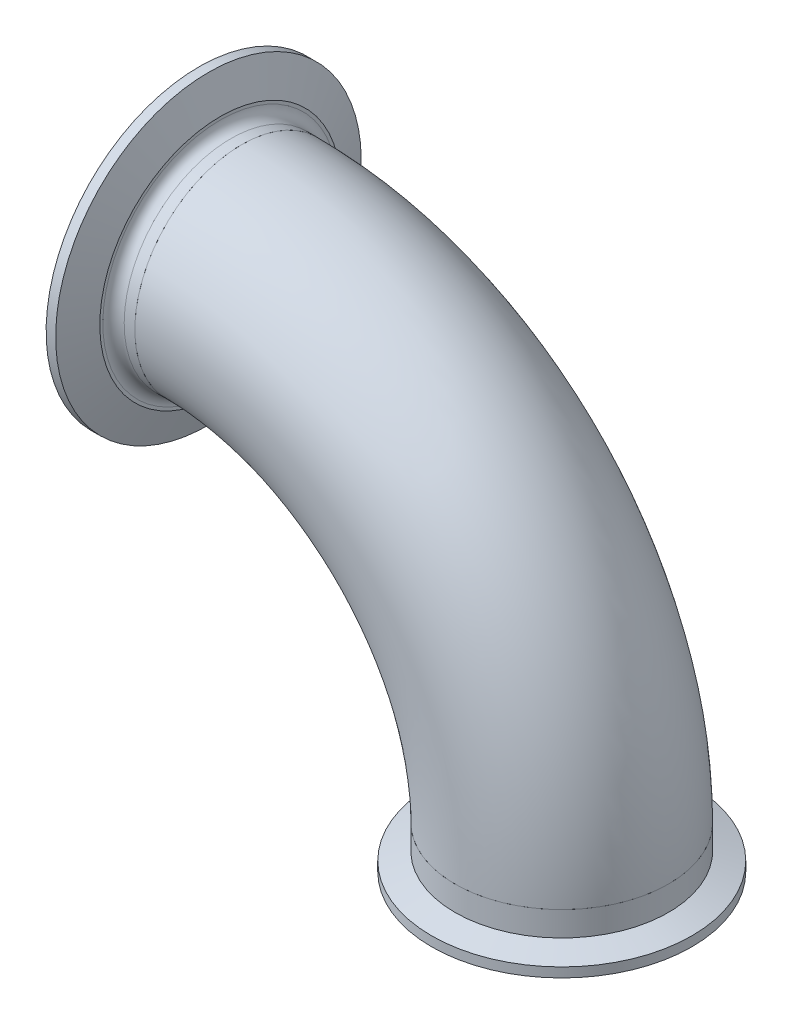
ISO-10303-21;
HEADER;
FILE_DESCRIPTION(('STEP AP214'),'2;1');
FILE_NAME('part.step','',(''),(''),'','','');
FILE_SCHEMA(('AUTOMOTIVE_DESIGN { 1 0 10303 214 1 1 1 1 }'));
ENDSEC;
DATA;
#1=APPLICATION_CONTEXT('core data for automotive mechanical design processes');
#2=APPLICATION_PROTOCOL_DEFINITION('international standard','automotive_design',2000,#1);
#3=PRODUCT_CONTEXT('',#1,'mechanical');
#4=PRODUCT('Part','Part','',(#3));
#5=PRODUCT_RELATED_PRODUCT_CATEGORY('part','',(#4));
#6=PRODUCT_DEFINITION_FORMATION('','',#4);
#7=PRODUCT_DEFINITION_CONTEXT('part definition',#1,'design');
#8=PRODUCT_DEFINITION('design','',#6,#7);
#9=PRODUCT_DEFINITION_SHAPE('','',#8);
#10=(LENGTH_UNIT() NAMED_UNIT(*) SI_UNIT(.MILLI.,.METRE.));
#11=(NAMED_UNIT(*) PLANE_ANGLE_UNIT() SI_UNIT($,.RADIAN.));
#12=(NAMED_UNIT(*) SI_UNIT($,.STERADIAN.) SOLID_ANGLE_UNIT());
#13=UNCERTAINTY_MEASURE_WITH_UNIT(LENGTH_MEASURE(1.E-05),#10,'distance_accuracy_value','');
#14=(GEOMETRIC_REPRESENTATION_CONTEXT(3) GLOBAL_UNCERTAINTY_ASSIGNED_CONTEXT((#13)) GLOBAL_UNIT_ASSIGNED_CONTEXT((#10,
#11,#12)) REPRESENTATION_CONTEXT('',''));
#15=CARTESIAN_POINT('',(0.,0.,0.));
#16=DIRECTION('',(0.,0.,1.));
#17=DIRECTION('',(1.,0.,0.));
#18=AXIS2_PLACEMENT_3D('',#15,#16,#17);
#19=CARTESIAN_POINT('',(5.89425065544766,43.0349954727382,135.177677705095));
#20=DIRECTION('',(0.,0.,-1.));
#21=DIRECTION('',(-1.,0.,0.));
#22=AXIS2_PLACEMENT_3D('',#19,#20,#21);
#23=TOROIDAL_SURFACE('',#22,95.25,31.75);
#24=CARTESIAN_POINT('',(5.89425065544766,138.284995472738,135.177677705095));
#25=DIRECTION('',(-1.,0.,0.));
#26=DIRECTION('',(0.,0.,1.));
#27=AXIS2_PLACEMENT_3D('',#24,#25,#26);
#28=CIRCLE('',#27,31.75);
#29=CARTESIAN_POINT('',(5.89425065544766,170.034995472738,135.177677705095));
#30=VERTEX_POINT('',#29);
#31=EDGE_CURVE('P0_E10',#30,#30,#28,.T.);
#32=CARTESIAN_POINT('',(101.144250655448,43.0349954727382,135.177677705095));
#33=DIRECTION('',(0.,1.,0.));
#34=DIRECTION('',(0.,0.,1.));
#35=AXIS2_PLACEMENT_3D('',#32,#33,#34);
#36=CIRCLE('',#35,31.75);
#37=CARTESIAN_POINT('',(132.894250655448,43.0349954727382,135.177677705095));
#38=VERTEX_POINT('',#37);
#39=EDGE_CURVE('P0_E21',#38,#38,#36,.T.);
#40=CARTESIAN_POINT('',(5.89425065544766,43.0349954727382,135.177677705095));
#41=DIRECTION('',(0.,0.,-1.));
#42=DIRECTION('',(-1.,0.,0.));
#43=AXIS2_PLACEMENT_3D('',#40,#41,#42);
#44=CIRCLE('',#43,127.);
#45=EDGE_CURVE('',#30,#38,#44,.T.);
#46=ORIENTED_EDGE('',*,*,#31,.F.);
#47=ORIENTED_EDGE('',*,*,#39,.T.);
#48=ORIENTED_EDGE('',*,*,#45,.T.);
#49=ORIENTED_EDGE('',*,*,#45,.F.);
#50=EDGE_LOOP('',(#46,#48,#47,#49));
#51=FACE_BOUND('',#50,.T.);
#52=ADVANCED_FACE('P0_F15',(#51),#23,.T.);
#53=CARTESIAN_POINT('',(5.89425065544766,138.284995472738,135.177677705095));
#54=DIRECTION('',(-1.,0.,0.));
#55=DIRECTION('',(0.,0.,1.));
#56=AXIS2_PLACEMENT_3D('',#53,#54,#55);
#57=PLANE('',#56);
#58=CARTESIAN_POINT('',(5.89425065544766,138.284995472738,135.177677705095));
#59=DIRECTION('',(-1.,0.,0.));
#60=DIRECTION('',(0.,-1.,0.));
#61=AXIS2_PLACEMENT_3D('',#58,#59,#60);
#62=CIRCLE('',#61,30.099);
#63=CARTESIAN_POINT('',(5.89425065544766,168.383995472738,135.177677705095));
#64=VERTEX_POINT('',#63);
#65=EDGE_CURVE('P0_E25',#64,#64,#62,.T.);
#66=ORIENTED_EDGE('',*,*,#65,.F.);
#67=EDGE_LOOP('',(#66));
#68=FACE_BOUND('',#67,.T.);
#69=ORIENTED_EDGE('',*,*,#31,.T.);
#70=EDGE_LOOP('',(#69));
#71=FACE_BOUND('',#70,.T.);
#72=ADVANCED_FACE('P0_F46',(#68,#71),#57,.T.);
#73=CARTESIAN_POINT('',(101.144250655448,43.0349954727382,135.177677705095));
#74=DIRECTION('',(0.,1.,0.));
#75=DIRECTION('',(0.,0.,1.));
#76=AXIS2_PLACEMENT_3D('',#73,#74,#75);
#77=PLANE('',#76);
#78=CARTESIAN_POINT('',(101.144250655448,43.0349954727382,135.177677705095));
#79=DIRECTION('',(0.,1.,0.));
#80=DIRECTION('',(0.,0.,1.));
#81=AXIS2_PLACEMENT_3D('',#78,#79,#80);
#82=CIRCLE('',#81,30.099);
#83=CARTESIAN_POINT('',(131.243250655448,43.0349954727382,135.177677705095));
#84=VERTEX_POINT('',#83);
#85=EDGE_CURVE('P0_E29',#84,#84,#82,.T.);
#86=ORIENTED_EDGE('',*,*,#85,.T.);
#87=EDGE_LOOP('',(#86));
#88=FACE_BOUND('',#87,.T.);
#89=ORIENTED_EDGE('',*,*,#39,.F.);
#90=EDGE_LOOP('',(#89));
#91=FACE_BOUND('',#90,.T.);
#92=ADVANCED_FACE('P0_F35',(#88,#91),#77,.F.);
#93=CARTESIAN_POINT('',(5.89425065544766,43.0349954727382,135.177677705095));
#94=DIRECTION('',(0.,0.,-1.));
#95=DIRECTION('',(-1.,0.,0.));
#96=AXIS2_PLACEMENT_3D('',#93,#94,#95);
#97=TOROIDAL_SURFACE('',#96,95.25,30.099);
#98=CARTESIAN_POINT('',(5.89425065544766,43.0349954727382,135.177677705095));
#99=DIRECTION('',(0.,0.,-1.));
#100=DIRECTION('',(-1.,0.,0.));
#101=AXIS2_PLACEMENT_3D('',#98,#99,#100);
#102=CIRCLE('',#101,125.349);
#103=EDGE_CURVE('',#64,#84,#102,.T.);
#104=ORIENTED_EDGE('',*,*,#65,.T.);
#105=ORIENTED_EDGE('',*,*,#85,.F.);
#106=ORIENTED_EDGE('',*,*,#103,.T.);
#107=ORIENTED_EDGE('',*,*,#103,.F.);
#108=EDGE_LOOP('',(#104,#106,#105,#107));
#109=FACE_BOUND('',#108,.T.);
#110=ADVANCED_FACE('P0_F38',(#109),#97,.F.);
#111=CLOSED_SHELL('',(#52,#72,#92,#110));
#112=MANIFOLD_SOLID_BREP('P0_B1',#111);
#113=CARTESIAN_POINT('',(5.89425065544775,162.342666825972,153.265746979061));
#114=DIRECTION('',(-1.,0.,0.));
#115=DIRECTION('',(0.,0.600952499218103,-0.799284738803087));
#116=AXIS2_PLACEMENT_3D('',#113,#114,#115);
#117=PLANE('',#116);
#118=CARTESIAN_POINT('',(5.89425065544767,138.284995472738,135.177677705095));
#119=DIRECTION('',(-1.,0.,0.));
#120=DIRECTION('',(0.,0.600952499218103,-0.799284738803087));
#121=AXIS2_PLACEMENT_3D('',#118,#119,#120);
#122=CIRCLE('',#121,31.75);
#123=CARTESIAN_POINT('',(5.89425065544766,157.365237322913,109.800387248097));
#124=VERTEX_POINT('',#123);
#125=EDGE_CURVE('P1_E9',#124,#124,#122,.T.);
#126=ORIENTED_EDGE('',*,*,#125,.F.);
#127=EDGE_LOOP('',(#126));
#128=FACE_BOUND('',#127,.T.);
#129=CARTESIAN_POINT('',(5.89425065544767,138.284995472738,135.177677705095));
#130=DIRECTION('',(-1.,0.,0.));
#131=DIRECTION('',(0.,0.600952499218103,-0.799284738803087));
#132=AXIS2_PLACEMENT_3D('',#129,#130,#131);
#133=CIRCLE('',#132,30.099);
#134=CARTESIAN_POINT('',(5.89425065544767,156.373064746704,111.120006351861));
#135=VERTEX_POINT('',#134);
#136=EDGE_CURVE('P1_E63',#135,#135,#133,.T.);
#137=ORIENTED_EDGE('',*,*,#136,.T.);
#138=EDGE_LOOP('',(#137));
#139=FACE_BOUND('',#138,.T.);
#140=ADVANCED_FACE('P1_F14',(#128,#139),#117,.F.);
#141=CARTESIAN_POINT('',(-6.80574934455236,138.284995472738,135.177677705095));
#142=DIRECTION('',(-1.,0.,0.));
#143=DIRECTION('',(0.,0.600952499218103,-0.799284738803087));
#144=AXIS2_PLACEMENT_3D('',#141,#142,#143);
#145=CYLINDRICAL_SURFACE('',#144,31.75);
#146=CARTESIAN_POINT('',(2.71925065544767,138.284995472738,135.177677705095));
#147=DIRECTION('',(-1.,0.,0.));
#148=DIRECTION('',(0.,0.600952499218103,-0.799284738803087));
#149=AXIS2_PLACEMENT_3D('',#146,#147,#148);
#150=CIRCLE('',#149,31.75);
#151=CARTESIAN_POINT('',(2.71925065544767,157.365237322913,109.800387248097));
#152=VERTEX_POINT('',#151);
#153=EDGE_CURVE('P1_E20',#152,#152,#150,.T.);
#154=ORIENTED_EDGE('',*,*,#153,.F.);
#155=EDGE_LOOP('',(#154));
#156=FACE_BOUND('',#155,.T.);
#157=ORIENTED_EDGE('',*,*,#125,.T.);
#158=EDGE_LOOP('',(#157));
#159=FACE_BOUND('',#158,.T.);
#160=ADVANCED_FACE('P1_F142',(#156,#159),#145,.T.);
#161=CARTESIAN_POINT('',(2.71925065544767,138.284995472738,135.177677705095));
#162=DIRECTION('',(-1.,0.,0.));
#163=DIRECTION('',(0.,0.600952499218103,-0.799284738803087));
#164=AXIS2_PLACEMENT_3D('',#161,#162,#163);
#165=TOROIDAL_SURFACE('',#164,34.925,3.175);
#166=CARTESIAN_POINT('',(-0.455749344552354,138.284995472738,135.177677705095));
#167=DIRECTION('',(-1.,0.,0.));
#168=DIRECTION('',(0.,0.600952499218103,-0.799284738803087));
#169=AXIS2_PLACEMENT_3D('',#166,#167,#168);
#170=CIRCLE('',#169,34.925);
#171=CARTESIAN_POINT('',(-0.455749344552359,159.27326150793,107.262658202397));
#172=VERTEX_POINT('',#171);
#173=EDGE_CURVE('P1_E24',#172,#172,#170,.T.);
#174=ORIENTED_EDGE('',*,*,#173,.F.);
#175=EDGE_LOOP('',(#174));
#176=FACE_BOUND('',#175,.T.);
#177=ORIENTED_EDGE('',*,*,#153,.T.);
#178=EDGE_LOOP('',(#177));
#179=FACE_BOUND('',#178,.T.);
#180=ADVANCED_FACE('P1_F137',(#176,#179),#165,.F.);
#181=CARTESIAN_POINT('',(-0.45574934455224,166.200014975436,156.165943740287));
#182=DIRECTION('',(-1.,0.,0.));
#183=DIRECTION('',(0.,0.600952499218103,-0.799284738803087));
#184=AXIS2_PLACEMENT_3D('',#181,#182,#183);
#185=PLANE('',#184);
#186=CARTESIAN_POINT('',(-0.455749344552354,138.284995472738,135.177677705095));
#187=DIRECTION('',(-1.,0.,0.));
#188=DIRECTION('',(0.,0.600952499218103,-0.799284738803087));
#189=AXIS2_PLACEMENT_3D('',#186,#187,#188);
#190=CIRCLE('',#189,35.8228421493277);
#191=CARTESIAN_POINT('',(-0.45574934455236,159.812821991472,106.545026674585));
#192=VERTEX_POINT('',#191);
#193=EDGE_CURVE('P1_E28',#192,#192,#190,.T.);
#194=ORIENTED_EDGE('',*,*,#193,.F.);
#195=EDGE_LOOP('',(#194));
#196=FACE_BOUND('',#195,.T.);
#197=ORIENTED_EDGE('',*,*,#173,.T.);
#198=EDGE_LOOP('',(#197));
#199=FACE_BOUND('',#198,.T.);
#200=ADVANCED_FACE('P1_F131',(#196,#199),#185,.F.);
#201=CARTESIAN_POINT('',(-0.455749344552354,138.284995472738,135.177677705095));
#202=DIRECTION('',(-1.,0.,0.));
#203=DIRECTION('',(0.,0.600952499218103,-0.799284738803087));
#204=AXIS2_PLACEMENT_3D('',#201,#202,#203);
#205=CONICAL_SURFACE('',#204,35.8228421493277,1.22173047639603);
#206=CARTESIAN_POINT('',(-3.96094934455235,138.284995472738,135.177677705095));
#207=DIRECTION('',(-1.,0.,0.));
#208=DIRECTION('',(0.,0.600952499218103,-0.799284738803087));
#209=AXIS2_PLACEMENT_3D('',#206,#207,#208);
#210=CIRCLE('',#209,45.4533);
#211=CARTESIAN_POINT('',(-3.96094934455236,165.600269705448,98.8475486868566));
#212=VERTEX_POINT('',#211);
#213=EDGE_CURVE('P1_E33',#212,#212,#210,.T.);
#214=ORIENTED_EDGE('',*,*,#213,.F.);
#215=EDGE_LOOP('',(#214));
#216=FACE_BOUND('',#215,.T.);
#217=ORIENTED_EDGE('',*,*,#193,.T.);
#218=EDGE_LOOP('',(#217));
#219=FACE_BOUND('',#218,.T.);
#220=ADVANCED_FACE('P1_F125',(#216,#219),#205,.T.);
#221=CARTESIAN_POINT('',(-6.80574934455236,138.284995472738,135.177677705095));
#222=DIRECTION('',(-1.,0.,0.));
#223=DIRECTION('',(0.,0.600952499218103,-0.799284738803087));
#224=AXIS2_PLACEMENT_3D('',#221,#222,#223);
#225=CYLINDRICAL_SURFACE('',#224,45.4533);
#226=CARTESIAN_POINT('',(-6.80574934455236,138.284995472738,135.177677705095));
#227=DIRECTION('',(-1.,0.,0.));
#228=DIRECTION('',(0.,0.600952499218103,-0.799284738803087));
#229=AXIS2_PLACEMENT_3D('',#226,#227,#228);
#230=CIRCLE('',#229,45.4533);
#231=CARTESIAN_POINT('',(-6.80574934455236,165.600269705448,98.8475486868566));
#232=VERTEX_POINT('',#231);
#233=EDGE_CURVE('P1_E36',#232,#232,#230,.T.);
#234=ORIENTED_EDGE('',*,*,#233,.F.);
#235=EDGE_LOOP('',(#234));
#236=FACE_BOUND('',#235,.T.);
#237=ORIENTED_EDGE('',*,*,#213,.T.);
#238=EDGE_LOOP('',(#237));
#239=FACE_BOUND('',#238,.T.);
#240=ADVANCED_FACE('P1_F119',(#236,#239),#225,.T.);
#241=CARTESIAN_POINT('',(-6.80574934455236,138.284995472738,135.177677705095));
#242=DIRECTION('',(-1.,0.,0.));
#243=DIRECTION('',(0.,0.600952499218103,-0.799284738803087));
#244=AXIS2_PLACEMENT_3D('',#241,#242,#243);
#245=CONICAL_SURFACE('',#244,45.4533,1.56939586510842);
#246=CARTESIAN_POINT('',(-6.80323687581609,138.284995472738,135.177677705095));
#247=DIRECTION('',(-1.,0.,0.));
#248=DIRECTION('',(0.,0.600952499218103,-0.799284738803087));
#249=AXIS2_PLACEMENT_3D('',#246,#247,#248);
#250=CIRCLE('',#249,43.6592722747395);
#251=CARTESIAN_POINT('',(-6.80323687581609,164.522144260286,100.281487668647));
#252=VERTEX_POINT('',#251);
#253=EDGE_CURVE('P1_E39',#252,#252,#250,.T.);
#254=ORIENTED_EDGE('',*,*,#253,.F.);
#255=EDGE_LOOP('',(#254));
#256=FACE_BOUND('',#255,.T.);
#257=ORIENTED_EDGE('',*,*,#233,.T.);
#258=EDGE_LOOP('',(#257));
#259=FACE_BOUND('',#258,.T.);
#260=ADVANCED_FACE('P1_F113',(#256,#259),#245,.F.);
#261=CARTESIAN_POINT('',(-6.01583687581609,138.284995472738,135.177677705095));
#262=DIRECTION('',(-1.,0.,0.));
#263=DIRECTION('',(0.,0.600952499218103,-0.799284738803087));
#264=AXIS2_PLACEMENT_3D('',#261,#262,#263);
#265=TOROIDAL_SURFACE('',#264,43.6592722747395,0.787399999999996);
#266=CARTESIAN_POINT('',(-6.32349856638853,138.284995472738,135.177677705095));
#267=DIRECTION('',(-1.,0.,0.));
#268=DIRECTION('',(0.,0.600952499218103,-0.799284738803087));
#269=AXIS2_PLACEMENT_3D('',#266,#267,#268);
#270=CIRCLE('',#269,42.9344667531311);
#271=CARTESIAN_POINT('',(-6.32349856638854,164.086570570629,100.860813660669));
#272=VERTEX_POINT('',#271);
#273=EDGE_CURVE('P1_E42',#272,#272,#270,.T.);
#274=ORIENTED_EDGE('',*,*,#273,.F.);
#275=EDGE_LOOP('',(#274));
#276=FACE_BOUND('',#275,.T.);
#277=ORIENTED_EDGE('',*,*,#253,.T.);
#278=EDGE_LOOP('',(#277));
#279=FACE_BOUND('',#278,.T.);
#280=ADVANCED_FACE('P1_F107',(#276,#279),#265,.T.);
#281=CARTESIAN_POINT('',(-6.32349856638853,138.284995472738,135.177677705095));
#282=DIRECTION('',(-1.,0.,0.));
#283=DIRECTION('',(0.,0.600952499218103,-0.799284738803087));
#284=AXIS2_PLACEMENT_3D('',#281,#282,#283);
#285=CONICAL_SURFACE('',#284,42.9344667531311,0.401425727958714);
#286=CARTESIAN_POINT('',(-5.9303820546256,138.284995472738,135.177677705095));
#287=DIRECTION('',(-1.,0.,0.));
#288=DIRECTION('',(0.,0.600952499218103,-0.799284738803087));
#289=AXIS2_PLACEMENT_3D('',#286,#287,#288);
#290=CIRCLE('',#289,42.7675986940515);
#291=CARTESIAN_POINT('',(-5.9303820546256,163.986290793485,100.994188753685));
#292=VERTEX_POINT('',#291);
#293=EDGE_CURVE('P1_E45',#292,#292,#290,.T.);
#294=ORIENTED_EDGE('',*,*,#293,.F.);
#295=EDGE_LOOP('',(#294));
#296=FACE_BOUND('',#295,.T.);
#297=ORIENTED_EDGE('',*,*,#273,.T.);
#298=EDGE_LOOP('',(#297));
#299=FACE_BOUND('',#298,.T.);
#300=ADVANCED_FACE('P1_F101',(#296,#299),#285,.F.);
#301=CARTESIAN_POINT('',(-6.39683687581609,138.284995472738,135.177677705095));
#302=DIRECTION('',(-1.,0.,0.));
#303=DIRECTION('',(0.,0.600952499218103,-0.799284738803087));
#304=AXIS2_PLACEMENT_3D('',#301,#302,#303);
#305=TOROIDAL_SURFACE('',#304,41.6687,1.19379999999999);
#306=CARTESIAN_POINT('',(-5.93038205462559,138.284995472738,135.177677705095));
#307=DIRECTION('',(-1.,0.,0.));
#308=DIRECTION('',(0.,0.600952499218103,-0.799284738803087));
#309=AXIS2_PLACEMENT_3D('',#306,#307,#308);
#310=CIRCLE('',#309,40.5698013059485);
#311=CARTESIAN_POINT('',(-5.9303820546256,162.66551896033,102.750854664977));
#312=VERTEX_POINT('',#311);
#313=EDGE_CURVE('P1_E48',#312,#312,#310,.T.);
#314=ORIENTED_EDGE('',*,*,#313,.F.);
#315=EDGE_LOOP('',(#314));
#316=FACE_BOUND('',#315,.T.);
#317=ORIENTED_EDGE('',*,*,#293,.T.);
#318=EDGE_LOOP('',(#317));
#319=FACE_BOUND('',#318,.T.);
#320=ADVANCED_FACE('P1_F95',(#316,#319),#305,.F.);
#321=CARTESIAN_POINT('',(-5.93038205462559,138.284995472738,135.177677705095));
#322=DIRECTION('',(1.,0.,0.));
#323=DIRECTION('',(0.,-0.600952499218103,0.799284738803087));
#324=AXIS2_PLACEMENT_3D('',#321,#322,#323);
#325=CONICAL_SURFACE('',#324,40.5698013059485,0.401425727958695);
#326=CARTESIAN_POINT('',(-6.32349856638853,138.284995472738,135.177677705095));
#327=DIRECTION('',(-1.,0.,0.));
#328=DIRECTION('',(0.,0.600952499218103,-0.799284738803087));
#329=AXIS2_PLACEMENT_3D('',#326,#327,#328);
#330=CIRCLE('',#329,40.402933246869);
#331=CARTESIAN_POINT('',(-6.32349856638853,162.565239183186,102.884229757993));
#332=VERTEX_POINT('',#331);
#333=EDGE_CURVE('P1_E51',#332,#332,#330,.T.);
#334=ORIENTED_EDGE('',*,*,#333,.F.);
#335=EDGE_LOOP('',(#334));
#336=FACE_BOUND('',#335,.T.);
#337=ORIENTED_EDGE('',*,*,#313,.T.);
#338=EDGE_LOOP('',(#337));
#339=FACE_BOUND('',#338,.T.);
#340=ADVANCED_FACE('P1_F89',(#336,#339),#325,.T.);
#341=CARTESIAN_POINT('',(-6.01583687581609,138.284995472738,135.177677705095));
#342=DIRECTION('',(-1.,0.,0.));
#343=DIRECTION('',(0.,0.600952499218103,-0.799284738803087));
#344=AXIS2_PLACEMENT_3D('',#341,#342,#343);
#345=TOROIDAL_SURFACE('',#344,39.6781277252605,0.787399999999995);
#346=CARTESIAN_POINT('',(-6.80323687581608,138.284995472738,135.177677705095));
#347=DIRECTION('',(-1.,0.,0.));
#348=DIRECTION('',(0.,0.600952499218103,-0.799284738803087));
#349=AXIS2_PLACEMENT_3D('',#346,#347,#348);
#350=CIRCLE('',#349,39.6781277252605);
#351=CARTESIAN_POINT('',(-6.80323687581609,162.129665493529,103.463555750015));
#352=VERTEX_POINT('',#351);
#353=EDGE_CURVE('P1_E54',#352,#352,#350,.T.);
#354=ORIENTED_EDGE('',*,*,#353,.F.);
#355=EDGE_LOOP('',(#354));
#356=FACE_BOUND('',#355,.T.);
#357=ORIENTED_EDGE('',*,*,#333,.T.);
#358=EDGE_LOOP('',(#357));
#359=FACE_BOUND('',#358,.T.);
#360=ADVANCED_FACE('P1_F83',(#356,#359),#345,.T.);
#361=CARTESIAN_POINT('',(-6.80323687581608,138.284995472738,135.177677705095));
#362=DIRECTION('',(1.,0.,0.));
#363=DIRECTION('',(0.,-0.600952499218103,0.799284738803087));
#364=AXIS2_PLACEMENT_3D('',#361,#362,#363);
#365=CONICAL_SURFACE('',#364,39.6781277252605,1.57001826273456);
#366=CARTESIAN_POINT('',(-6.80574934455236,138.284995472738,135.177677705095));
#367=DIRECTION('',(-1.,0.,0.));
#368=DIRECTION('',(0.,0.600952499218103,-0.799284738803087));
#369=AXIS2_PLACEMENT_3D('',#366,#367,#368);
#370=CIRCLE('',#369,36.449);
#371=CARTESIAN_POINT('',(-6.80574934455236,160.189113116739,106.044548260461));
#372=VERTEX_POINT('',#371);
#373=EDGE_CURVE('P1_E57',#372,#372,#370,.T.);
#374=ORIENTED_EDGE('',*,*,#373,.F.);
#375=EDGE_LOOP('',(#374));
#376=FACE_BOUND('',#375,.T.);
#377=ORIENTED_EDGE('',*,*,#353,.T.);
#378=EDGE_LOOP('',(#377));
#379=FACE_BOUND('',#378,.T.);
#380=ADVANCED_FACE('P1_F77',(#376,#379),#365,.T.);
#381=CARTESIAN_POINT('',(-6.80574934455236,138.284995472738,135.177677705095));
#382=DIRECTION('',(-1.,0.,0.));
#383=DIRECTION('',(0.,0.600952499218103,-0.799284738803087));
#384=AXIS2_PLACEMENT_3D('',#381,#382,#383);
#385=CONICAL_SURFACE('',#384,36.449,0.682423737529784);
#386=CARTESIAN_POINT('',(1.00792390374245,138.284995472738,135.177677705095));
#387=DIRECTION('',(-1.,0.,0.));
#388=DIRECTION('',(0.,0.600952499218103,-0.799284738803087));
#389=AXIS2_PLACEMENT_3D('',#386,#387,#388);
#390=CIRCLE('',#389,30.099);
#391=CARTESIAN_POINT('',(1.00792390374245,156.373064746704,111.120006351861));
#392=VERTEX_POINT('',#391);
#393=EDGE_CURVE('P1_E60',#392,#392,#390,.T.);
#394=ORIENTED_EDGE('',*,*,#393,.F.);
#395=EDGE_LOOP('',(#394));
#396=FACE_BOUND('',#395,.T.);
#397=ORIENTED_EDGE('',*,*,#373,.T.);
#398=EDGE_LOOP('',(#397));
#399=FACE_BOUND('',#398,.T.);
#400=ADVANCED_FACE('P1_F71',(#396,#399),#385,.F.);
#401=CARTESIAN_POINT('',(-6.80574934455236,138.284995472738,135.177677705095));
#402=DIRECTION('',(-1.,0.,0.));
#403=DIRECTION('',(0.,0.600952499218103,-0.799284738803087));
#404=AXIS2_PLACEMENT_3D('',#401,#402,#403);
#405=CYLINDRICAL_SURFACE('',#404,30.099);
#406=ORIENTED_EDGE('',*,*,#136,.F.);
#407=EDGE_LOOP('',(#406));
#408=FACE_BOUND('',#407,.T.);
#409=ORIENTED_EDGE('',*,*,#393,.T.);
#410=EDGE_LOOP('',(#409));
#411=FACE_BOUND('',#410,.T.);
#412=ADVANCED_FACE('P1_F68',(#408,#411),#405,.F.);
#413=CLOSED_SHELL('',(#140,#160,#180,#200,#220,#240,#260,#280,#300,#320,#340,#360,#380,#400,#412));
#414=MANIFOLD_SOLID_BREP('P1_B1',#413);
#415=CARTESIAN_POINT('',(101.144250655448,31.1223954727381,135.177677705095));
#416=DIRECTION('',(0.,-1.00000000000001,0.));
#417=DIRECTION('',(0.,0.,-1.));
#418=AXIS2_PLACEMENT_3D('',#415,#416,#417);
#419=TOROIDAL_SURFACE('',#418,37.1367084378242,0.787400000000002);
#420=CARTESIAN_POINT('',(101.144250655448,30.334995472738,135.177677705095));
#421=DIRECTION('',(0.,-1.00000000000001,0.));
#422=DIRECTION('',(0.,0.,-1.));
#423=AXIS2_PLACEMENT_3D('',#420,#421,#422);
#424=CIRCLE('',#423,37.1367084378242);
#425=CARTESIAN_POINT('',(101.144250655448,30.334995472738,98.0409692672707));
#426=VERTEX_POINT('',#425);
#427=EDGE_CURVE('P2_E49',#426,#426,#424,.T.);
#428=ORIENTED_EDGE('',*,*,#427,.T.);
#429=EDGE_LOOP('',(#428));
#430=FACE_BOUND('',#429,.T.);
#431=CARTESIAN_POINT('',(101.144250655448,30.8094544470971,135.177677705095));
#432=DIRECTION('',(0.,-1.00000000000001,0.));
#433=DIRECTION('',(0.,0.,-1.));
#434=AXIS2_PLACEMENT_3D('',#431,#432,#433);
#435=CIRCLE('',#434,36.4141666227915);
#436=CARTESIAN_POINT('',(101.144250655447,30.809454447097,98.7635110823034));
#437=VERTEX_POINT('',#436);
#438=EDGE_CURVE('P2_E10',#437,#437,#435,.T.);
#439=ORIENTED_EDGE('',*,*,#438,.F.);
#440=EDGE_LOOP('',(#439));
#441=FACE_BOUND('',#440,.T.);
#442=ADVANCED_FACE('P2_F15',(#430,#441),#419,.T.);
#443=CARTESIAN_POINT('',(101.144250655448,30.334995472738,135.177677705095));
#444=DIRECTION('',(0.,-1.00000000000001,0.));
#445=DIRECTION('',(0.,0.,-1.));
#446=AXIS2_PLACEMENT_3D('',#443,#444,#445);
#447=TOROIDAL_SURFACE('',#446,35.3187,1.1938);
#448=CARTESIAN_POINT('',(101.144250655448,30.8094544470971,135.177677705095));
#449=DIRECTION('',(0.,-1.00000000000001,0.));
#450=DIRECTION('',(0.,0.,-1.));
#451=AXIS2_PLACEMENT_3D('',#448,#449,#450);
#452=CIRCLE('',#451,34.2232333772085);
#453=CARTESIAN_POINT('',(101.144250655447,30.809454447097,100.954444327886));
#454=VERTEX_POINT('',#453);
#455=EDGE_CURVE('P2_E21',#454,#454,#452,.T.);
#456=ORIENTED_EDGE('',*,*,#455,.F.);
#457=EDGE_LOOP('',(#456));
#458=FACE_BOUND('',#457,.T.);
#459=ORIENTED_EDGE('',*,*,#438,.T.);
#460=EDGE_LOOP('',(#459));
#461=FACE_BOUND('',#460,.T.);
#462=ADVANCED_FACE('P2_F98',(#458,#461),#447,.F.);
#463=CARTESIAN_POINT('',(101.144250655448,31.1223954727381,135.177677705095));
#464=DIRECTION('',(0.,-1.00000000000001,0.));
#465=DIRECTION('',(0.,0.,-1.));
#466=AXIS2_PLACEMENT_3D('',#463,#464,#465);
#467=TOROIDAL_SURFACE('',#466,33.5006915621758,0.787399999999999);
#468=ORIENTED_EDGE('',*,*,#455,.T.);
#469=EDGE_LOOP('',(#468));
#470=FACE_BOUND('',#469,.T.);
#471=CARTESIAN_POINT('',(101.144250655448,30.334995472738,135.177677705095));
#472=DIRECTION('',(0.,-1.00000000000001,0.));
#473=DIRECTION('',(0.,0.,-1.));
#474=AXIS2_PLACEMENT_3D('',#471,#472,#473);
#475=CIRCLE('',#474,33.5006915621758);
#476=CARTESIAN_POINT('',(101.144250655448,30.334995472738,101.676986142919));
#477=VERTEX_POINT('',#476);
#478=EDGE_CURVE('P2_E25',#477,#477,#475,.T.);
#479=ORIENTED_EDGE('',*,*,#478,.F.);
#480=EDGE_LOOP('',(#479));
#481=FACE_BOUND('',#480,.T.);
#482=ADVANCED_FACE('P2_F94',(#470,#481),#467,.T.);
#483=CARTESIAN_POINT('',(101.144250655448,30.334995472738,135.177677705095));
#484=DIRECTION('',(0.,1.00000000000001,0.));
#485=DIRECTION('',(0.,0.,1.));
#486=AXIS2_PLACEMENT_3D('',#483,#484,#485);
#487=PLANE('',#486);
#488=CARTESIAN_POINT('',(101.144250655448,30.334995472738,135.177677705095));
#489=DIRECTION('',(0.,-1.00000000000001,0.));
#490=DIRECTION('',(0.,0.,-1.));
#491=AXIS2_PLACEMENT_3D('',#488,#489,#490);
#492=CIRCLE('',#491,30.099);
#493=CARTESIAN_POINT('',(101.144250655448,30.334995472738,105.078677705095));
#494=VERTEX_POINT('',#493);
#495=EDGE_CURVE('P2_E29',#494,#494,#492,.T.);
#496=ORIENTED_EDGE('',*,*,#495,.F.);
#497=EDGE_LOOP('',(#496));
#498=FACE_BOUND('',#497,.T.);
#499=ORIENTED_EDGE('',*,*,#478,.T.);
#500=EDGE_LOOP('',(#499));
#501=FACE_BOUND('',#500,.T.);
#502=ADVANCED_FACE('P2_F87',(#498,#501),#487,.F.);
#503=CARTESIAN_POINT('',(101.144250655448,30.334995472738,135.177677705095));
#504=DIRECTION('',(0.,-1.00000000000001,0.));
#505=DIRECTION('',(0.,0.,-1.));
#506=AXIS2_PLACEMENT_3D('',#503,#504,#505);
#507=CYLINDRICAL_SURFACE('',#506,30.099);
#508=ORIENTED_EDGE('',*,*,#495,.T.);
#509=EDGE_LOOP('',(#508));
#510=FACE_BOUND('',#509,.T.);
#511=CARTESIAN_POINT('',(101.144250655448,43.0349954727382,135.177677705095));
#512=DIRECTION('',(0.,-1.00000000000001,0.));
#513=DIRECTION('',(0.,0.,-1.));
#514=AXIS2_PLACEMENT_3D('',#511,#512,#513);
#515=CIRCLE('',#514,30.099);
#516=CARTESIAN_POINT('',(101.144250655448,43.0349954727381,105.078677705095));
#517=VERTEX_POINT('',#516);
#518=EDGE_CURVE('P2_E34',#517,#517,#515,.T.);
#519=ORIENTED_EDGE('',*,*,#518,.F.);
#520=EDGE_LOOP('',(#519));
#521=FACE_BOUND('',#520,.T.);
#522=ADVANCED_FACE('P2_F82',(#510,#521),#507,.F.);
#523=CARTESIAN_POINT('',(101.144250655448,43.0349954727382,135.177677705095));
#524=DIRECTION('',(0.,-1.00000000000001,0.));
#525=DIRECTION('',(0.,0.,-1.));
#526=AXIS2_PLACEMENT_3D('',#523,#524,#525);
#527=PLANE('',#526);
#528=CARTESIAN_POINT('',(101.144250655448,43.0349954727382,135.177677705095));
#529=DIRECTION('',(0.,-1.00000000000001,0.));
#530=DIRECTION('',(0.,0.,-1.));
#531=AXIS2_PLACEMENT_3D('',#528,#529,#530);
#532=CIRCLE('',#531,31.75);
#533=CARTESIAN_POINT('',(101.144250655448,43.0349954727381,103.427677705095));
#534=VERTEX_POINT('',#533);
#535=EDGE_CURVE('P2_E37',#534,#534,#532,.T.);
#536=ORIENTED_EDGE('',*,*,#535,.F.);
#537=EDGE_LOOP('',(#536));
#538=FACE_BOUND('',#537,.T.);
#539=ORIENTED_EDGE('',*,*,#518,.T.);
#540=EDGE_LOOP('',(#539));
#541=FACE_BOUND('',#540,.T.);
#542=ADVANCED_FACE('P2_F76',(#538,#541),#527,.F.);
#543=CARTESIAN_POINT('',(101.144250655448,30.334995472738,135.177677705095));
#544=DIRECTION('',(0.,-1.00000000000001,0.));
#545=DIRECTION('',(0.,0.,-1.));
#546=AXIS2_PLACEMENT_3D('',#543,#544,#545);
#547=CYLINDRICAL_SURFACE('',#546,31.75);
#548=CARTESIAN_POINT('',(101.144250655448,35.7128827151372,135.177677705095));
#549=DIRECTION('',(0.,-1.00000000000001,0.));
#550=DIRECTION('',(0.,0.,-1.));
#551=AXIS2_PLACEMENT_3D('',#548,#549,#550);
#552=CIRCLE('',#551,31.75);
#553=CARTESIAN_POINT('',(101.144250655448,35.7128827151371,103.427677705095));
#554=VERTEX_POINT('',#553);
#555=EDGE_CURVE('P2_E40',#554,#554,#552,.T.);
#556=ORIENTED_EDGE('',*,*,#555,.F.);
#557=EDGE_LOOP('',(#556));
#558=FACE_BOUND('',#557,.T.);
#559=ORIENTED_EDGE('',*,*,#535,.T.);
#560=EDGE_LOOP('',(#559));
#561=FACE_BOUND('',#560,.T.);
#562=ADVANCED_FACE('P2_F70',(#558,#561),#547,.T.);
#563=CARTESIAN_POINT('',(101.144250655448,35.7128827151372,135.177677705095));
#564=DIRECTION('',(0.,-1.00000000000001,0.));
#565=DIRECTION('',(0.,0.,-1.));
#566=AXIS2_PLACEMENT_3D('',#563,#564,#565);
#567=CONICAL_SURFACE('',#566,31.75,1.22173047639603);
#568=CARTESIAN_POINT('',(101.144250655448,33.1797954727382,135.177677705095));
#569=DIRECTION('',(0.,-1.00000000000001,0.));
#570=DIRECTION('',(0.,0.,-1.));
#571=AXIS2_PLACEMENT_3D('',#568,#569,#570);
#572=CIRCLE('',#571,38.7096);
#573=CARTESIAN_POINT('',(101.144250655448,33.1797954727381,96.468077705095));
#574=VERTEX_POINT('',#573);
#575=EDGE_CURVE('P2_E43',#574,#574,#572,.T.);
#576=ORIENTED_EDGE('',*,*,#575,.F.);
#577=EDGE_LOOP('',(#576));
#578=FACE_BOUND('',#577,.T.);
#579=ORIENTED_EDGE('',*,*,#555,.T.);
#580=EDGE_LOOP('',(#579));
#581=FACE_BOUND('',#580,.T.);
#582=ADVANCED_FACE('P2_F64',(#578,#581),#567,.T.);
#583=CARTESIAN_POINT('',(101.144250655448,30.334995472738,135.177677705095));
#584=DIRECTION('',(0.,-1.00000000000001,0.));
#585=DIRECTION('',(0.,0.,-1.));
#586=AXIS2_PLACEMENT_3D('',#583,#584,#585);
#587=CYLINDRICAL_SURFACE('',#586,38.7096);
#588=CARTESIAN_POINT('',(101.144250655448,30.334995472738,135.177677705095));
#589=DIRECTION('',(0.,-1.00000000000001,0.));
#590=DIRECTION('',(0.,0.,-1.));
#591=AXIS2_PLACEMENT_3D('',#588,#589,#590);
#592=CIRCLE('',#591,38.7096);
#593=CARTESIAN_POINT('',(101.144250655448,30.334995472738,96.4680777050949));
#594=VERTEX_POINT('',#593);
#595=EDGE_CURVE('P2_E46',#594,#594,#592,.T.);
#596=ORIENTED_EDGE('',*,*,#595,.F.);
#597=EDGE_LOOP('',(#596));
#598=FACE_BOUND('',#597,.T.);
#599=ORIENTED_EDGE('',*,*,#575,.T.);
#600=EDGE_LOOP('',(#599));
#601=FACE_BOUND('',#600,.T.);
#602=ADVANCED_FACE('P2_F58',(#598,#601),#587,.T.);
#603=CARTESIAN_POINT('',(101.144250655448,30.334995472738,135.177677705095));
#604=DIRECTION('',(0.,1.00000000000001,0.));
#605=DIRECTION('',(0.,0.,1.));
#606=AXIS2_PLACEMENT_3D('',#603,#604,#605);
#607=PLANE('',#606);
#608=ORIENTED_EDGE('',*,*,#427,.F.);
#609=EDGE_LOOP('',(#608));
#610=FACE_BOUND('',#609,.T.);
#611=ORIENTED_EDGE('',*,*,#595,.T.);
#612=EDGE_LOOP('',(#611));
#613=FACE_BOUND('',#612,.T.);
#614=ADVANCED_FACE('P2_F55',(#610,#613),#607,.F.);
#615=CLOSED_SHELL('',(#442,#462,#482,#502,#522,#542,#562,#582,#602,#614));
#616=MANIFOLD_SOLID_BREP('P2_B1',#615);
#617=ADVANCED_BREP_SHAPE_REPRESENTATION('',(#18,#112,#414,#616),#14);
#618=SHAPE_DEFINITION_REPRESENTATION(#9,#617);
ENDSEC;
END-ISO-10303-21;
